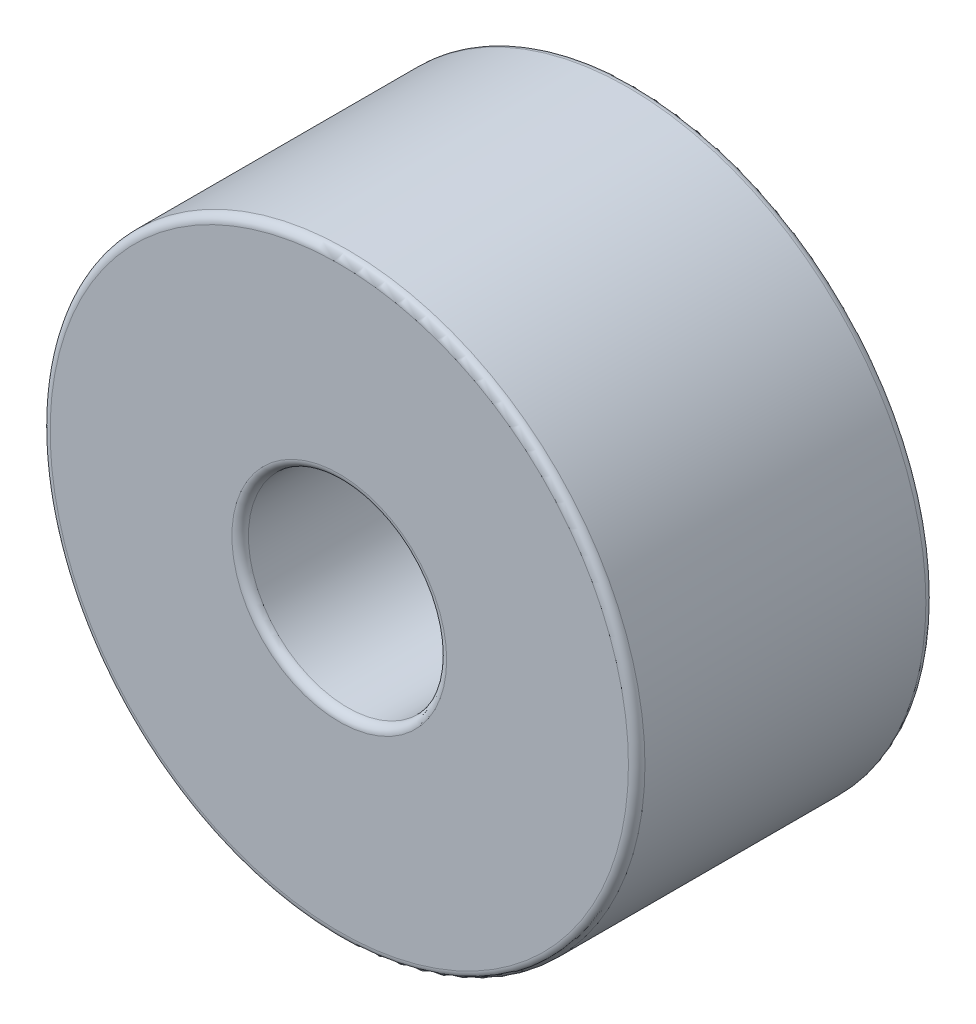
from build123d import *

# Parameters (mm, degrees)
ESQUISSE1_R      = 18
ESQUISSE1_R_2    = 6
EXTRUSION1_DEPTH = 18
CONG_1_R         = 0.5


with BuildPart() as part:
    # Esquisse1 → Extrusion1 (new body)
    with BuildSketch(Plane.XY):
        Circle(ESQUISSE1_R)
        Circle(ESQUISSE1_R_2, mode=Mode.SUBTRACT)
    extrude(amount=EXTRUSION1_DEPTH)

    # Cong_1
    cong_1_edges = [part.edges().sort_by_distance(p)[0] for p in [
        (-18, 0, 0),
        (-18, 0, 18),
        (-6, 0, 0),
        (-6, 0, 18),
    ]]
    fillet(cong_1_edges, radius=CONG_1_R)


solid = part.part
